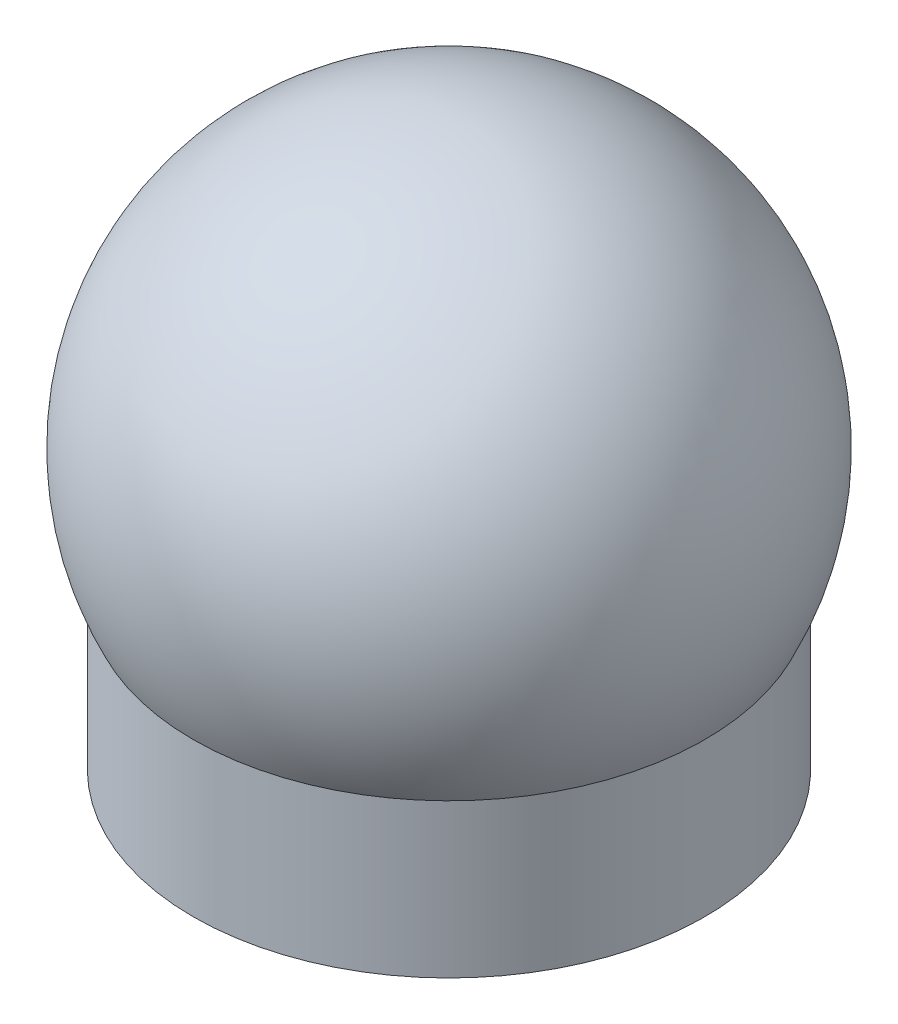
from build123d import *

# Parameters (mm, degrees)
SKETCH1_R           = 50
BOSS_EXTRUDE1_DEPTH = 30
DOME1_FACE_RADIUS   = 50
DOME1_HEIGHT        = 80


with BuildPart() as part:
    # Sketch1 → Boss-Extrude1 (new body)
    with BuildSketch(Plane(origin=(0, 0, 0), x_dir=(1, 0, 0), z_dir=(0, 1, 0))):
        with Locations(Location((0, 0, 0), (0, 0, 270))):
            Circle(SKETCH1_R)
    extrude(amount=BOSS_EXTRUDE1_DEPTH)

    # Dome1: a dome of height H over a round flat face of radius A is a cap of a sphere of radius (A * A + H * H) / (2 * H)
    dome1_r = (DOME1_FACE_RADIUS * DOME1_FACE_RADIUS + DOME1_HEIGHT * DOME1_HEIGHT) / (2 * DOME1_HEIGHT)
    dome1_base = Plane((0, 30, 0), z_dir=(0, 1, 0))
    with Locations(dome1_base.offset(DOME1_HEIGHT - dome1_r)):
        dome1_ball = Sphere(dome1_r, mode=Mode.PRIVATE)
    add(split(dome1_ball, bisect_by=dome1_base, keep=Keep.TOP, mode=Mode.PRIVATE))


solid = part.part
